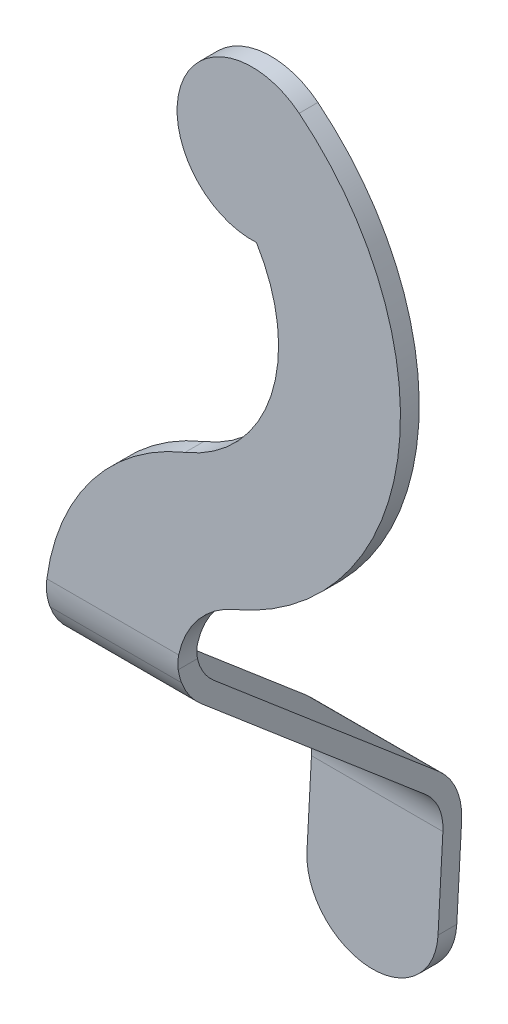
ISO-10303-21;
HEADER;
FILE_DESCRIPTION(('STEP AP214'),'2;1');
FILE_NAME('part.step','',(''),(''),'','','');
FILE_SCHEMA(('AUTOMOTIVE_DESIGN { 1 0 10303 214 1 1 1 1 }'));
ENDSEC;
DATA;
#1=APPLICATION_CONTEXT('core data for automotive mechanical design processes');
#2=APPLICATION_PROTOCOL_DEFINITION('international standard','automotive_design',2000,#1);
#3=PRODUCT_CONTEXT('',#1,'mechanical');
#4=PRODUCT('Part','Part','',(#3));
#5=PRODUCT_RELATED_PRODUCT_CATEGORY('part','',(#4));
#6=PRODUCT_DEFINITION_FORMATION('','',#4);
#7=PRODUCT_DEFINITION_CONTEXT('part definition',#1,'design');
#8=PRODUCT_DEFINITION('design','',#6,#7);
#9=PRODUCT_DEFINITION_SHAPE('','',#8);
#10=(LENGTH_UNIT() NAMED_UNIT(*) SI_UNIT(.MILLI.,.METRE.));
#11=(NAMED_UNIT(*) PLANE_ANGLE_UNIT() SI_UNIT($,.RADIAN.));
#12=(NAMED_UNIT(*) SI_UNIT($,.STERADIAN.) SOLID_ANGLE_UNIT());
#13=UNCERTAINTY_MEASURE_WITH_UNIT(LENGTH_MEASURE(1.E-05),#10,'distance_accuracy_value','');
#14=(GEOMETRIC_REPRESENTATION_CONTEXT(3) GLOBAL_UNCERTAINTY_ASSIGNED_CONTEXT((#13)) GLOBAL_UNIT_ASSIGNED_CONTEXT((#10,
#11,#12)) REPRESENTATION_CONTEXT('',''));
#15=CARTESIAN_POINT('',(0.,0.,0.));
#16=DIRECTION('',(0.,0.,1.));
#17=DIRECTION('',(1.,0.,0.));
#18=AXIS2_PLACEMENT_3D('',#15,#16,#17);
#19=CARTESIAN_POINT('',(-10.,0.,0.999999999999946));
#20=DIRECTION('',(0.,0.,-1.));
#21=DIRECTION('',(0.,1.,0.));
#22=AXIS2_PLACEMENT_3D('',#19,#20,#21);
#23=PLANE('',#22);
#24=DIRECTION('',(1.,0.,0.));
#25=VECTOR('',#24,1.);
#26=CARTESIAN_POINT('',(-10.,20.842816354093,0.999999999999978));
#27=LINE('',#26,#25);
#28=CARTESIAN_POINT('',(-2.36711950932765,20.842816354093,0.999999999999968));
#29=VERTEX_POINT('',#28);
#30=CARTESIAN_POINT('',(4.66500634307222,20.842816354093,0.999999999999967));
#31=VERTEX_POINT('',#30);
#32=EDGE_CURVE('E446',#29,#31,#27,.T.);
#33=ORIENTED_EDGE('',*,*,#32,.T.);
#34=CARTESIAN_POINT('',(9.55611055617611,19.8049822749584,0.999999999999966));
#35=DIRECTION('',(0.,0.,-1.));
#36=DIRECTION('',(0.,1.,0.));
#37=AXIS2_PLACEMENT_3D('',#34,#35,#36);
#38=CIRCLE('',#37,4.99999999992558);
#39=CARTESIAN_POINT('',(7.61659852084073,24.4134845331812,0.999999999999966));
#40=VERTEX_POINT('',#39);
#41=EDGE_CURVE('E564',#31,#40,#38,.T.);
#42=ORIENTED_EDGE('',*,*,#41,.T.);
#43=CARTESIAN_POINT('',(1.99201361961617,37.7781410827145,0.999999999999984));
#44=DIRECTION('',(0.,0.,-1.));
#45=DIRECTION('',(0.,1.,0.));
#46=AXIS2_PLACEMENT_3D('',#43,#44,#45);
#47=CIRCLE('',#46,14.4999999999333);
#48=CARTESIAN_POINT('',(11.0888032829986,49.0696608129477,0.99999999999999));
#49=VERTEX_POINT('',#48);
#50=EDGE_CURVE('E614',#49,#40,#47,.T.);
#51=ORIENTED_EDGE('',*,*,#50,.F.);
#52=CARTESIAN_POINT('',(8.57934406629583,45.9547588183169,0.999999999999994));
#53=DIRECTION('',(0.,0.,-1.));
#54=DIRECTION('',(0.,1.,0.));
#55=AXIS2_PLACEMENT_3D('',#52,#53,#54);
#56=CIRCLE('',#55,3.99999999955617);
#57=CARTESIAN_POINT('',(8.81108233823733,41.9614772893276,0.99999999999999));
#58=VERTEX_POINT('',#57);
#59=EDGE_CURVE('E608',#58,#49,#56,.T.);
#60=ORIENTED_EDGE('',*,*,#59,.F.);
#61=CARTESIAN_POINT('',(1.99201361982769,37.778141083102,0.999999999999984));
#62=DIRECTION('',(0.,0.,-1.));
#63=DIRECTION('',(0.,1.,0.));
#64=AXIS2_PLACEMENT_3D('',#61,#62,#63);
#65=CIRCLE('',#64,8.00000000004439);
#66=CARTESIAN_POINT('',(5.00598510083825,30.3676096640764,0.999999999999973));
#67=VERTEX_POINT('',#66);
#68=EDGE_CURVE('E604',#58,#67,#65,.T.);
#69=ORIENTED_EDGE('',*,*,#68,.T.);
#70=CARTESIAN_POINT('',(9.52694232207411,19.2518125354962,0.999999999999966));
#71=DIRECTION('',(0.,0.,-1.));
#72=DIRECTION('',(0.,1.,0.));
#73=AXIS2_PLACEMENT_3D('',#70,#71,#72);
#74=CIRCLE('',#73,11.9999999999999);
#75=EDGE_CURVE('E601',#29,#67,#74,.T.);
#76=ORIENTED_EDGE('',*,*,#75,.F.);
#77=EDGE_LOOP('',(#33,#42,#51,#60,#69,#76));
#78=FACE_BOUND('',#77,.T.);
#79=ADVANCED_FACE('F114',(#78),#23,.F.);
#80=CARTESIAN_POINT('',(-10.,19.3387542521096,0.70670391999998));
#81=CARTESIAN_POINT('',(-10.,19.3988779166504,0.729932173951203));
#82=CARTESIAN_POINT('',(-10.,19.5190078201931,0.776343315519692));
#83=CARTESIAN_POINT('',(-10.,19.703047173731,0.8349949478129));
#84=CARTESIAN_POINT('',(-10.,19.8894266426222,0.885510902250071));
#85=CARTESIAN_POINT('',(-10.,20.141069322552,0.940537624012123));
#86=CARTESIAN_POINT('',(-10.,20.4593617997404,0.98922796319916));
#87=CARTESIAN_POINT('',(-10.,20.715222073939,0.996415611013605));
#88=CARTESIAN_POINT('',(-10.,20.842816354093,0.999999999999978));
#89=B_SPLINE_CURVE_WITH_KNOTS('',3,(#80,#81,#82,#83,#84,#85,#86,#87,#88),.UNSPECIFIED.,.F.,.F.,
(4,1,1,1,1,1,4),(0.,0.125110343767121,0.249976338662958,0.374880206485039,0.500103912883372,
0.750708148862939,1.),.UNSPECIFIED.);
#90=DIRECTION('',(1.,0.,0.));
#91=VECTOR('',#90,1.);
#92=SURFACE_OF_LINEAR_EXTRUSION('',#89,#91);
#93=CARTESIAN_POINT('',(4.56304703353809,20.0682628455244,0.923431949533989));
#94=CARTESIAN_POINT('',(4.56140497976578,20.0371216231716,0.917239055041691));
#95=CARTESIAN_POINT('',(4.5597663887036,20.0060460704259,0.910714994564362));
#96=CARTESIAN_POINT('',(4.55649746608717,19.9440516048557,0.89696034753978));
#97=CARTESIAN_POINT('',(4.55486713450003,19.9131326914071,0.889729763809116));
#98=CARTESIAN_POINT('',(4.54999018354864,19.8206422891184,0.866910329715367));
#99=CARTESIAN_POINT('',(4.54675793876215,19.759343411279,0.850195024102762));
#100=CARTESIAN_POINT('',(4.54247761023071,19.6781678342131,0.826162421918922));
#101=CARTESIAN_POINT('',(4.54141083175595,19.6579365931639,0.820014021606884));
#102=CARTESIAN_POINT('',(4.5392827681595,19.6175782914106,0.807387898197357));
#103=CARTESIAN_POINT('',(4.53822148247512,19.5974512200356,0.800910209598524));
#104=CARTESIAN_POINT('',(4.53610421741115,19.5572977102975,0.787584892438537));
#105=CARTESIAN_POINT('',(4.53504824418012,19.5372713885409,0.780736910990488));
#106=CARTESIAN_POINT('',(4.53294351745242,19.4973556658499,0.766647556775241));
#107=CARTESIAN_POINT('',(4.53189476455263,19.4774662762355,0.75940615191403));
#108=CARTESIAN_POINT('',(4.5298003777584,19.4377466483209,0.744652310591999));
#109=CARTESIAN_POINT('',(4.52875475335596,19.4179165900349,0.737139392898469));
#110=CARTESIAN_POINT('',(4.52666626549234,19.3783088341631,0.721985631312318));
#111=CARTESIAN_POINT('',(4.52562340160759,19.3585311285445,0.714344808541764));
#112=CARTESIAN_POINT('',(4.52458058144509,19.3387542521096,0.70670391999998));
#113=B_SPLINE_CURVE_WITH_KNOTS('',3,(#93,#94,#95,#96,#97,#98,#99,#100,#101,#102,#103,#104,#105,
#106,#107,#108,#109,#110,#111,#112),.UNSPECIFIED.,.F.,.F.,(4,2,2,2,2,2,2,2,2,4),(0.,
0.095377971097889,0.190755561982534,0.381529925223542,0.445044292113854,0.508552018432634,
0.572121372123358,0.635695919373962,0.699389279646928,0.763072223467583),.UNSPECIFIED.);
#114=CARTESIAN_POINT('',(4.56304703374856,20.0682628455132,0.923431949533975));
#115=VERTEX_POINT('',#114);
#116=CARTESIAN_POINT('',(4.52458058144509,19.3387542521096,0.70670391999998));
#117=VERTEX_POINT('',#116);
#118=EDGE_CURVE('E124',#115,#117,#113,.T.);
#119=ORIENTED_EDGE('',*,*,#118,.F.);
#120=CARTESIAN_POINT('',(4.56304703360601,20.0682628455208,0.923431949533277));
#121=CARTESIAN_POINT('',(4.5664090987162,20.1320939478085,0.936115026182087));
#122=CARTESIAN_POINT('',(4.57101981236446,20.1961820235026,0.947466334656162));
#123=CARTESIAN_POINT('',(4.58274687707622,20.3243788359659,0.966758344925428));
#124=CARTESIAN_POINT('',(4.58985343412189,20.3884865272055,0.974712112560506));
#125=CARTESIAN_POINT('',(4.60673701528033,20.5177300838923,0.986663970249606));
#126=CARTESIAN_POINT('',(4.61655401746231,20.5828663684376,0.990598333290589));
#127=CARTESIAN_POINT('',(4.63881491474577,20.7130594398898,0.996367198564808));
#128=CARTESIAN_POINT('',(4.651269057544,20.7781148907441,0.998193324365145));
#129=CARTESIAN_POINT('',(4.66500634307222,20.842816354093,0.999999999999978));
#130=B_SPLINE_CURVE_WITH_KNOTS('',3,(#120,#121,#122,#123,#124,#125,#126,#127,#128,#129),
.UNSPECIFIED.,.F.,.F.,(4,2,2,2,4),(0.,0.195565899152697,0.390372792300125,0.588222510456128,
0.786855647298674),.UNSPECIFIED.);
#131=EDGE_CURVE('E562',#115,#31,#130,.T.);
#132=ORIENTED_EDGE('',*,*,#131,.T.);
#133=ORIENTED_EDGE('',*,*,#32,.F.);
#134=CARTESIAN_POINT('',(-2.45641013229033,19.8836859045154,0.882464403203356));
#135=CARTESIAN_POINT('',(-2.45475858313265,19.9150104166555,0.890184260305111));
#136=CARTESIAN_POINT('',(-2.45297888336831,19.9464232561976,0.897510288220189));
#137=CARTESIAN_POINT('',(-2.4491609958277,20.0094032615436,0.911433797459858));
#138=CARTESIAN_POINT('',(-2.447122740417,20.0409704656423,0.918031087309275));
#139=CARTESIAN_POINT('',(-2.44279366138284,20.104114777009,0.930531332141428));
#140=CARTESIAN_POINT('',(-2.44050370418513,20.1356914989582,0.936436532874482));
#141=CARTESIAN_POINT('',(-2.43566341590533,20.1989503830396,0.947505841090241));
#142=CARTESIAN_POINT('',(-2.4331131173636,20.2306325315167,0.952670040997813));
#143=CARTESIAN_POINT('',(-2.42637457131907,20.310365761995,0.964618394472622));
#144=CARTESIAN_POINT('',(-2.42201674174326,20.3584841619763,0.970876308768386));
#145=CARTESIAN_POINT('',(-2.41502488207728,20.4307978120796,0.978631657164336));
#146=CARTESIAN_POINT('',(-2.41261790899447,20.4549296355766,0.980945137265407));
#147=CARTESIAN_POINT('',(-2.40765265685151,20.5032245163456,0.985021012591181));
#148=CARTESIAN_POINT('',(-2.4050943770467,20.5273875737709,0.986783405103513));
#149=CARTESIAN_POINT('',(-2.39716917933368,20.6001267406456,0.991438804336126));
#150=CARTESIAN_POINT('',(-2.39157463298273,20.6487175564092,0.993676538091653));
#151=CARTESIAN_POINT('',(-2.37979134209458,20.7458300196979,0.997276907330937));
#152=CARTESIAN_POINT('',(-2.37360298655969,20.7943516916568,0.998640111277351));
#153=CARTESIAN_POINT('',(-2.36711950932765,20.842816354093,0.999999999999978));
#154=B_SPLINE_CURVE_WITH_KNOTS('',3,(#134,#135,#136,#137,#138,#139,#140,#141,#142,#143,#144,
#145,#146,#147,#148,#149,#150,#151,#152,#153),.UNSPECIFIED.,.F.,.F.,(4,2,2,2,2,2,2,2,2,4),(0.,
0.0969062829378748,0.193837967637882,0.290445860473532,0.387041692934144,0.533144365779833,
0.606223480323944,0.679302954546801,0.826173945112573,0.97294936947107),.UNSPECIFIED.);
#155=CARTESIAN_POINT('',(-2.45641013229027,19.8836859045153,0.882464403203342));
#156=VERTEX_POINT('',#155);
#157=EDGE_CURVE('E140',#156,#29,#154,.T.);
#158=ORIENTED_EDGE('',*,*,#157,.F.);
#159=CARTESIAN_POINT('',(-2.48514397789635,19.3387542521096,0.70670391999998));
#160=CARTESIAN_POINT('',(-2.48357691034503,19.3684733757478,0.718183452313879));
#161=CARTESIAN_POINT('',(-2.48200951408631,19.3981987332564,0.729668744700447));
#162=CARTESIAN_POINT('',(-2.47886763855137,19.4577837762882,0.752188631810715));
#163=CARTESIAN_POINT('',(-2.47729316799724,19.4876432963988,0.763223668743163));
#164=CARTESIAN_POINT('',(-2.47412853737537,19.5476598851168,0.784399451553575));
#165=CARTESIAN_POINT('',(-2.47253838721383,19.5778167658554,0.794540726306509));
#166=CARTESIAN_POINT('',(-2.46934490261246,19.6383805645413,0.814037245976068));
#167=CARTESIAN_POINT('',(-2.467741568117,19.6687874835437,0.823392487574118));
#168=CARTESIAN_POINT('',(-2.46452364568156,19.7298147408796,0.841445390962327));
#169=CARTESIAN_POINT('',(-2.46290905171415,19.7604351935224,0.850142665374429));
#170=CARTESIAN_POINT('',(-2.45966799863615,19.8219011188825,0.866840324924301));
#171=CARTESIAN_POINT('',(-2.45804152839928,19.8527468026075,0.874839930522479));
#172=CARTESIAN_POINT('',(-2.45641013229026,19.8836859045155,0.882464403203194));
#173=B_SPLINE_CURVE_WITH_KNOTS('',3,(#159,#160,#161,#162,#163,#164,#165,#166,#167,#168,#169,
#170,#171,#172),.UNSPECIFIED.,.F.,.F.,(4,2,2,2,2,2,4),(0.,0.0957068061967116,0.191317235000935,
0.28687070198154,0.382424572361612,0.47803426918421,0.573749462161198),.UNSPECIFIED.);
#174=CARTESIAN_POINT('',(-2.48514397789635,19.3387542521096,0.70670391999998));
#175=VERTEX_POINT('',#174);
#176=EDGE_CURVE('E389',#175,#156,#173,.T.);
#177=ORIENTED_EDGE('',*,*,#176,.F.);
#178=DIRECTION('',(1.,0.,0.));
#179=VECTOR('',#178,1.);
#180=CARTESIAN_POINT('',(-10.,19.3387542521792,0.706703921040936));
#181=LINE('',#180,#179);
#182=EDGE_CURVE('E372',#175,#117,#181,.T.);
#183=ORIENTED_EDGE('',*,*,#182,.T.);
#184=EDGE_LOOP('',(#119,#132,#133,#158,#177,#183));
#185=FACE_BOUND('',#184,.T.);
#186=ADVANCED_FACE('F306',(#185),#92,.F.);
#187=CARTESIAN_POINT('',(-10.,20.855369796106,-3.00000000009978));
#188=DIRECTION('',(-1.,0.,0.));
#189=DIRECTION('',(0.,1.,1.59339260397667E-11));
#190=AXIS2_PLACEMENT_3D('',#187,#188,#189);
#191=ELLIPSE('',#190,4.03504171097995,3.99999999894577);
#192=DIRECTION('',(1.,0.,0.));
#193=VECTOR('',#192,1.);
#194=SURFACE_OF_LINEAR_EXTRUSION('',#191,#193);
#195=CARTESIAN_POINT('',(4.52458058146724,19.3387542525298,0.706703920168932));
#196=CARTESIAN_POINT('',(4.51897737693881,19.2324905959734,0.663990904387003));
#197=CARTESIAN_POINT('',(4.51346976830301,19.1280398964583,0.616751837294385));
#198=CARTESIAN_POINT('',(4.50268231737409,18.9234580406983,0.513571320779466));
#199=CARTESIAN_POINT('',(4.49740257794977,18.8233288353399,0.457625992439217));
#200=CARTESIAN_POINT('',(4.48721429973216,18.6301101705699,0.338610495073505));
#201=CARTESIAN_POINT('',(4.48230048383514,18.5369206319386,0.275703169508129));
#202=CARTESIAN_POINT('',(4.47276866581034,18.3561516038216,0.142353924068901));
#203=CARTESIAN_POINT('',(4.46815050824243,18.268569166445,0.0719160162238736));
#204=CARTESIAN_POINT('',(4.45991825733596,18.1124461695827,-0.064790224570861));
#205=CARTESIAN_POINT('',(4.45625824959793,18.043034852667,-0.130064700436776));
#206=CARTESIAN_POINT('',(4.44916133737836,17.9084433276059,-0.265962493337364));
#207=CARTESIAN_POINT('',(4.44572660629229,17.8433043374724,-0.336626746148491));
#208=CARTESIAN_POINT('',(4.4424300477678,17.7807857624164,-0.409554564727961));
#209=B_SPLINE_CURVE_WITH_KNOTS('',3,(#195,#196,#197,#198,#199,#200,#201,#202,#203,#204,#205,
#206,#207,#208),.UNSPECIFIED.,.F.,.F.,(4,2,2,2,2,2,4),(0.,0.343891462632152,0.687936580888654,
1.02517554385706,1.36223572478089,1.6480581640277,1.9363226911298),.UNSPECIFIED.);
#210=CARTESIAN_POINT('',(4.4424300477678,17.7807857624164,-0.40955456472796));
#211=VERTEX_POINT('',#210);
#212=EDGE_CURVE('E407',#117,#211,#209,.T.);
#213=ORIENTED_EDGE('',*,*,#212,.F.);
#214=ORIENTED_EDGE('',*,*,#182,.F.);
#215=CARTESIAN_POINT('',(-2.56729451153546,17.7807857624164,-0.40955456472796));
#216=CARTESIAN_POINT('',(-2.56336189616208,17.8553670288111,-0.322545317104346));
#217=CARTESIAN_POINT('',(-2.55923189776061,17.9336916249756,-0.238757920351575));
#218=CARTESIAN_POINT('',(-2.55060894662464,18.0972241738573,-0.0781540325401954));
#219=CARTESIAN_POINT('',(-2.54611586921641,18.1824344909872,-0.00133995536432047));
#220=CARTESIAN_POINT('',(-2.53689303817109,18.3573436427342,0.143291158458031));
#221=CARTESIAN_POINT('',(-2.53216968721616,18.4469210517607,0.211255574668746));
#222=CARTESIAN_POINT('',(-2.52244332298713,18.6313796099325,0.339440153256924));
#223=CARTESIAN_POINT('',(-2.51744045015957,18.7262580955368,0.3996641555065));
#224=CARTESIAN_POINT('',(-2.50796810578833,18.905899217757,0.503460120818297));
#225=CARTESIAN_POINT('',(-2.50353311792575,18.9900078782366,0.548171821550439));
#226=CARTESIAN_POINT('',(-2.49447008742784,19.1618864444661,0.631915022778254));
#227=CARTESIAN_POINT('',(-2.48984072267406,19.2496814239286,0.670894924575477));
#228=CARTESIAN_POINT('',(-2.48514397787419,19.3387542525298,0.706703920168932));
#229=B_SPLINE_CURVE_WITH_KNOTS('',3,(#215,#216,#217,#218,#219,#220,#221,#222,#223,#224,#225,
#226,#227,#228),.UNSPECIFIED.,.F.,.F.,(4,2,2,2,2,2,4),(0.,0.343891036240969,0.687900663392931,
1.02513625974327,1.36220390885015,1.64804604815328,1.93632168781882),.UNSPECIFIED.);
#230=CARTESIAN_POINT('',(-2.56729451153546,17.7807857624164,-0.40955456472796));
#231=VERTEX_POINT('',#230);
#232=EDGE_CURVE('E465',#231,#175,#229,.T.);
#233=ORIENTED_EDGE('',*,*,#232,.F.);
#234=DIRECTION('',(1.,0.,0.));
#235=VECTOR('',#234,1.);
#236=CARTESIAN_POINT('',(-10.,17.7807857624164,-0.409554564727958));
#237=LINE('',#236,#235);
#238=EDGE_CURVE('E369',#231,#211,#237,.T.);
#239=ORIENTED_EDGE('',*,*,#238,.T.);
#240=EDGE_LOOP('',(#213,#214,#233,#239));
#241=FACE_BOUND('',#240,.T.);
#242=ADVANCED_FACE('F457',(#241),#194,.F.);
#243=CARTESIAN_POINT('',(-10.,10.4502579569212,-8.95965251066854));
#244=DIRECTION('',(0.,0.759174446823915,-0.650887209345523));
#245=DIRECTION('',(0.,0.650887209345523,0.759174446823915));
#246=AXIS2_PLACEMENT_3D('',#243,#244,#245);
#247=PLANE('',#246);
#248=DIRECTION('',(-0.0343006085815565,-0.650504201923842,-0.758727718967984));
#249=VECTOR('',#248,1.);
#250=CARTESIAN_POINT('',(4.03935949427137,10.1366330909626,-9.32545472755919));
#251=LINE('',#250,#249);
#252=CARTESIAN_POINT('',(3.87582478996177,7.0352300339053,-12.9428340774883));
#253=VERTEX_POINT('',#252);
#254=EDGE_CURVE('E531',#211,#253,#251,.T.);
#255=ORIENTED_EDGE('',*,*,#254,.F.);
#256=ORIENTED_EDGE('',*,*,#238,.F.);
#257=DIRECTION('',(0.034300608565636,0.650504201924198,0.758727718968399));
#258=VECTOR('',#257,1.);
#259=CARTESIAN_POINT('',(-2.96211790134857,10.2930389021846,-9.14302788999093));
#260=LINE('',#259,#258);
#261=CARTESIAN_POINT('',(-3.13389976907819,7.0352300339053,-12.9428340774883));
#262=VERTEX_POINT('',#261);
#263=EDGE_CURVE('E473',#262,#231,#260,.T.);
#264=ORIENTED_EDGE('',*,*,#263,.F.);
#265=DIRECTION('',(1.,0.,0.));
#266=VECTOR('',#265,1.);
#267=CARTESIAN_POINT('',(-10.,7.0352300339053,-12.9428340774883));
#268=LINE('',#267,#266);
#269=EDGE_CURVE('E365',#262,#253,#268,.T.);
#270=ORIENTED_EDGE('',*,*,#269,.T.);
#271=EDGE_LOOP('',(#255,#256,#264,#270));
#272=FACE_BOUND('',#271,.T.);
#273=ADVANCED_FACE('F461',(#272),#247,.F.);
#274=CARTESIAN_POINT('',(-10.,4.7292920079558,-11.0000000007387));
#275=DIRECTION('',(-1.,0.,0.));
#276=DIRECTION('',(0.,1.,0.));
#277=AXIS2_PLACEMENT_3D('',#274,#275,#276);
#278=ELLIPSE('',#277,3.02628128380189,3.);
#279=DIRECTION('',(1.,0.,0.));
#280=VECTOR('',#279,1.);
#281=SURFACE_OF_LINEAR_EXTRUSION('',#278,#280);
#282=DIRECTION('',(1.,0.,0.));
#283=VECTOR('',#282,1.);
#284=CARTESIAN_POINT('',(-10.,4.72929200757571,-14.0000000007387));
#285=LINE('',#284,#283);
#286=CARTESIAN_POINT('',(-3.25549018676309,4.72929200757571,-14.0000000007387));
#287=VERTEX_POINT('',#286);
#288=CARTESIAN_POINT('',(3.75423437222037,4.72929200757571,-14.0000000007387));
#289=VERTEX_POINT('',#288);
#290=EDGE_CURVE('E361',#287,#289,#285,.T.);
#291=ORIENTED_EDGE('',*,*,#290,.T.);
#292=CARTESIAN_POINT('',(3.75423437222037,4.72929200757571,-14.0000000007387));
#293=CARTESIAN_POINT('',(3.75869049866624,4.8138015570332,-14.000008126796));
#294=CARTESIAN_POINT('',(3.76314657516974,4.89831015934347,-13.9964911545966));
#295=CARTESIAN_POINT('',(3.7720280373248,5.06674531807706,-13.9824654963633));
#296=CARTESIAN_POINT('',(3.77645342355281,5.15067188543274,-13.9719569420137));
#297=CARTESIAN_POINT('',(3.78524323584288,5.31736892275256,-13.9440061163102));
#298=CARTESIAN_POINT('',(3.78960765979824,5.40013935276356,-13.9265636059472));
#299=CARTESIAN_POINT('',(3.79824513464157,5.56394734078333,-13.8848611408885));
#300=CARTESIAN_POINT('',(3.80251818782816,5.64498494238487,-13.8606013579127));
#301=CARTESIAN_POINT('',(3.81093242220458,5.80455921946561,-13.8054931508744));
#302=CARTESIAN_POINT('',(3.81507391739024,5.88310184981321,-13.7746620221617));
#303=CARTESIAN_POINT('',(3.8232078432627,6.03736013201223,-13.7065758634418));
#304=CARTESIAN_POINT('',(3.8272002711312,6.11307573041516,-13.6693207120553));
#305=CARTESIAN_POINT('',(3.83526530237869,6.26602743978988,-13.5859718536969));
#306=CARTESIAN_POINT('',(3.83932588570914,6.34303559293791,-13.5394577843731));
#307=CARTESIAN_POINT('',(3.84721353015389,6.49262319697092,-13.4397579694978));
#308=CARTESIAN_POINT('',(3.85104057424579,6.56520232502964,-13.386571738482));
#309=CARTESIAN_POINT('',(3.85855398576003,6.70769267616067,-13.2720374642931));
#310=CARTESIAN_POINT('',(3.86223131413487,6.77743247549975,-13.2104753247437));
#311=CARTESIAN_POINT('',(3.86927182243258,6.91095431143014,-13.0811638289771));
#312=CARTESIAN_POINT('',(3.87263495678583,6.97473548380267,-13.0134135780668));
#313=CARTESIAN_POINT('',(3.87582478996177,7.0352300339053,-12.9428340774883));
#314=B_SPLINE_CURVE_WITH_KNOTS('',3,(#292,#293,#294,#295,#296,#297,#298,#299,#300,#301,#302,
#303,#304,#305,#306,#307,#308,#309,#310,#311,#312,#313),.UNSPECIFIED.,.F.,.F.,(4,2,2,2,2,2,2,2,
2,2,4),(0.,0.253806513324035,0.507608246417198,0.761418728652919,1.01522281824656,
1.26836698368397,1.52151593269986,1.79132766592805,2.06115904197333,2.34005114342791,
2.61898363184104),.UNSPECIFIED.);
#315=EDGE_CURVE('E416',#289,#253,#314,.T.);
#316=ORIENTED_EDGE('',*,*,#315,.T.);
#317=ORIENTED_EDGE('',*,*,#269,.F.);
#318=CARTESIAN_POINT('',(-3.13389976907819,7.0352300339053,-12.9428340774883));
#319=CARTESIAN_POINT('',(-3.13677985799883,6.98060972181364,-13.0065548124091));
#320=CARTESIAN_POINT('',(-3.13980101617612,6.92331405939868,-13.0679715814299));
#321=CARTESIAN_POINT('',(-3.14610210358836,6.80381519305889,-13.1858047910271));
#322=CARTESIAN_POINT('',(-3.14938201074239,6.74161240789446,-13.2422216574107));
#323=CARTESIAN_POINT('',(-3.15617773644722,6.61273282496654,-13.3496738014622));
#324=CARTESIAN_POINT('',(-3.15969355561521,6.54605601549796,-13.4007090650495));
#325=CARTESIAN_POINT('',(-3.16693608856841,6.40870282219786,-13.4970599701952));
#326=CARTESIAN_POINT('',(-3.17066280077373,6.33802646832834,-13.5423756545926));
#327=CARTESIAN_POINT('',(-3.17830087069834,6.19317199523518,-13.6269865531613));
#328=CARTESIAN_POINT('',(-3.18221221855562,6.11899406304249,-13.6662820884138));
#329=CARTESIAN_POINT('',(-3.19019258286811,5.9676480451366,-13.7385999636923));
#330=CARTESIAN_POINT('',(-3.19426160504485,5.89047985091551,-13.7716220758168));
#331=CARTESIAN_POINT('',(-3.20286737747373,5.72727309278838,-13.8336127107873));
#332=CARTESIAN_POINT('',(-3.20741517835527,5.641024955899,-13.8620295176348));
#333=CARTESIAN_POINT('',(-3.21662634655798,5.46633698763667,-13.9110582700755));
#334=CARTESIAN_POINT('',(-3.22128972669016,5.37789691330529,-13.9316693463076));
#335=CARTESIAN_POINT('',(-3.23085272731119,5.19653651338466,-13.9654842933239));
#336=CARTESIAN_POINT('',(-3.23575502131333,5.10356548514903,-13.9784160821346));
#337=CARTESIAN_POINT('',(-3.24560161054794,4.91682688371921,-13.9956804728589));
#338=CARTESIAN_POINT('',(-3.25054590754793,4.82305927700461,-14.000012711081));
#339=CARTESIAN_POINT('',(-3.25549018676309,4.72929200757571,-14.0000000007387));
#340=B_SPLINE_CURVE_WITH_KNOTS('',3,(#318,#319,#320,#321,#322,#323,#324,#325,#326,#327,#328,
#329,#330,#331,#332,#333,#334,#335,#336,#337,#338,#339),.UNSPECIFIED.,.F.,.F.,(4,2,2,2,2,2,2,2,
2,2,4),(0.,0.251850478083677,0.503679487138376,0.755509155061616,1.00733693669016,
1.25915128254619,1.51097477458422,1.78337541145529,2.05580637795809,2.33738888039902,
2.61898329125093),.UNSPECIFIED.);
#341=EDGE_CURVE('E478',#262,#287,#340,.T.);
#342=ORIENTED_EDGE('',*,*,#341,.T.);
#343=EDGE_LOOP('',(#291,#316,#317,#342));
#344=FACE_BOUND('',#343,.T.);
#345=ADVANCED_FACE('F488',(#344),#281,.T.);
#346=CARTESIAN_POINT('',(-10.,0.,-14.0000000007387));
#347=DIRECTION('',(0.,0.,-1.));
#348=DIRECTION('',(-1.,0.,0.));
#349=AXIS2_PLACEMENT_3D('',#346,#347,#348);
#350=PLANE('',#349);
#351=DIRECTION('',(-0.0526561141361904,-0.998612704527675,0.));
#352=VECTOR('',#351,1.);
#353=CARTESIAN_POINT('',(3.46741780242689,-0.710127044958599,-14.0000000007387));
#354=LINE('',#353,#352);
#355=CARTESIAN_POINT('',(3.49514446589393,-0.184296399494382,-14.0000000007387));
#356=VERTEX_POINT('',#355);
#357=EDGE_CURVE('E537',#289,#356,#354,.T.);
#358=ORIENTED_EDGE('',*,*,#357,.F.);
#359=ORIENTED_EDGE('',*,*,#290,.F.);
#360=DIRECTION('',(0.0526561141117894,0.998612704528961,0.));
#361=VECTOR('',#360,1.);
#362=CARTESIAN_POINT('',(-3.52287112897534,-0.341534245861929,-14.0000000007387));
#363=LINE('',#362,#361);
#364=CARTESIAN_POINT('',(-3.49514446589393,0.184296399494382,-14.0000000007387));
#365=VERTEX_POINT('',#364);
#366=EDGE_CURVE('E486',#365,#287,#363,.T.);
#367=ORIENTED_EDGE('',*,*,#366,.F.);
#368=CARTESIAN_POINT('',(0.,0.,-14.0000000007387));
#369=DIRECTION('',(0.,0.,-1.));
#370=DIRECTION('',(-1.,0.,0.));
#371=AXIS2_PLACEMENT_3D('',#368,#369,#370);
#372=CIRCLE('',#371,3.50000000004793);
#373=EDGE_CURVE('E13',#356,#365,#372,.T.);
#374=ORIENTED_EDGE('',*,*,#373,.F.);
#375=EDGE_LOOP('',(#358,#359,#367,#374));
#376=FACE_BOUND('',#375,.T.);
#377=ADVANCED_FACE('F492',(#376),#350,.F.);
#378=CARTESIAN_POINT('',(0.,0.,-14.9999999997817));
#379=DIRECTION('',(0.,0.,1.));
#380=DIRECTION('',(1.,0.,0.));
#381=AXIS2_PLACEMENT_3D('',#378,#379,#380);
#382=CYLINDRICAL_SURFACE('',#381,3.50000000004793);
#383=CARTESIAN_POINT('',(0.,0.,-14.9999999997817));
#384=DIRECTION('',(0.,0.,1.));
#385=DIRECTION('',(1.,0.,0.));
#386=AXIS2_PLACEMENT_3D('',#383,#384,#385);
#387=CIRCLE('',#386,3.50000000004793);
#388=CARTESIAN_POINT('',(-3.49514446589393,0.184296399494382,-14.9999999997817));
#389=VERTEX_POINT('',#388);
#390=CARTESIAN_POINT('',(3.49514446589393,-0.184296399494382,-14.9999999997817));
#391=VERTEX_POINT('',#390);
#392=EDGE_CURVE('E250',#389,#391,#387,.T.);
#393=ORIENTED_EDGE('',*,*,#392,.T.);
#394=DIRECTION('',(0.,0.,1.));
#395=VECTOR('',#394,1.);
#396=CARTESIAN_POINT('',(3.49514446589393,-0.184296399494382,-14.9999999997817));
#397=LINE('',#396,#395);
#398=EDGE_CURVE('E257',#391,#356,#397,.T.);
#399=ORIENTED_EDGE('',*,*,#398,.T.);
#400=ORIENTED_EDGE('',*,*,#373,.T.);
#401=DIRECTION('',(0.,0.,1.));
#402=VECTOR('',#401,1.);
#403=CARTESIAN_POINT('',(-3.49514446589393,0.184296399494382,-14.9999999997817));
#404=LINE('',#403,#402);
#405=EDGE_CURVE('E243',#389,#365,#404,.T.);
#406=ORIENTED_EDGE('',*,*,#405,.F.);
#407=EDGE_LOOP('',(#393,#399,#400,#406));
#408=FACE_BOUND('',#407,.T.);
#409=ADVANCED_FACE('F253',(#408),#382,.T.);
#410=CARTESIAN_POINT('',(3.49514446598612,-0.18429639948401,-14.9999999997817));
#411=DIRECTION('',(0.998612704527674,-0.0526561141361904,0.));
#412=DIRECTION('',(0.0526561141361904,0.998612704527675,0.));
#413=AXIS2_PLACEMENT_3D('',#410,#411,#412);
#414=PLANE('',#413);
#415=CARTESIAN_POINT('',(4.52458058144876,19.3387542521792,-0.403915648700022));
#416=CARTESIAN_POINT('',(4.52610158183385,19.3675997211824,-0.388307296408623));
#417=CARTESIAN_POINT('',(4.52762250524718,19.3964437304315,-0.372679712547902));
#418=CARTESIAN_POINT('',(4.53067752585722,19.4543815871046,-0.341864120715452));
#419=CARTESIAN_POINT('',(4.53221162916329,19.4834755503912,-0.326676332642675));
#420=CARTESIAN_POINT('',(4.53529831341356,19.5420139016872,-0.297297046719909));
#421=CARTESIAN_POINT('',(4.53685078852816,19.5714562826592,-0.283101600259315));
#422=CARTESIAN_POINT('',(4.53998491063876,19.6308942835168,-0.255942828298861));
#423=CARTESIAN_POINT('',(4.54156655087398,19.6608897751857,-0.242979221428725));
#424=CARTESIAN_POINT('',(4.54477481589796,19.7217338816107,-0.217941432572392));
#425=CARTESIAN_POINT('',(4.54640176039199,19.7525885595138,-0.20588212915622));
#426=CARTESIAN_POINT('',(4.54967508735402,19.8146665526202,-0.182735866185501));
#427=CARTESIAN_POINT('',(4.55132147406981,19.845889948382,-0.171649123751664));
#428=CARTESIAN_POINT('',(4.55463868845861,19.9088002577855,-0.150388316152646));
#429=CARTESIAN_POINT('',(4.55630959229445,19.9404886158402,-0.140218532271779));
#430=CARTESIAN_POINT('',(4.55966682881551,20.0041579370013,-0.120897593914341));
#431=CARTESIAN_POINT('',(4.56135315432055,20.0361387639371,-0.111745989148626));
#432=CARTESIAN_POINT('',(4.5630470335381,20.0682628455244,-0.103124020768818));
#433=B_SPLINE_CURVE_WITH_KNOTS('',3,(#415,#416,#417,#418,#419,#420,#421,#422,#423,#424,#425,
#426,#427,#428,#429,#430,#431,#432),.UNSPECIFIED.,.F.,.F.,(4,2,2,2,2,2,2,2,4),(0.,
0.0985119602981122,0.197072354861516,0.295215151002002,0.393335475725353,0.49282052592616,
0.592327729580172,0.692277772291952,0.792183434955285),.UNSPECIFIED.);
#434=CARTESIAN_POINT('',(4.52458058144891,19.3387542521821,-0.403915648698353));
#435=VERTEX_POINT('',#434);
#436=CARTESIAN_POINT('',(4.56304703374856,20.0682628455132,-0.103124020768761));
#437=VERTEX_POINT('',#436);
#438=EDGE_CURVE('E439',#435,#437,#433,.T.);
#439=ORIENTED_EDGE('',*,*,#438,.T.);
#440=DIRECTION('',(0.,0.,1.));
#441=VECTOR('',#440,1.);
#442=CARTESIAN_POINT('',(4.56304703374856,20.0682628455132,-14.9999999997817));
#443=LINE('',#442,#441);
#444=EDGE_CURVE('E281',#437,#115,#443,.T.);
#445=ORIENTED_EDGE('',*,*,#444,.T.);
#446=ORIENTED_EDGE('',*,*,#118,.T.);
#447=ORIENTED_EDGE('',*,*,#212,.T.);
#448=ORIENTED_EDGE('',*,*,#254,.T.);
#449=ORIENTED_EDGE('',*,*,#315,.F.);
#450=ORIENTED_EDGE('',*,*,#357,.T.);
#451=ORIENTED_EDGE('',*,*,#398,.F.);
#452=DIRECTION('',(0.0526561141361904,0.998612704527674,0.));
#453=VECTOR('',#452,1.);
#454=CARTESIAN_POINT('',(3.49514446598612,-0.18429639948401,-14.9999999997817));
#455=LINE('',#454,#453);
#456=CARTESIAN_POINT('',(3.75423437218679,4.729292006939,-14.9999999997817));
#457=VERTEX_POINT('',#456);
#458=EDGE_CURVE('E262',#391,#457,#455,.T.);
#459=ORIENTED_EDGE('',*,*,#458,.T.);
#460=CARTESIAN_POINT('',(3.75423437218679,4.729292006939,-14.9999999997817));
#461=CARTESIAN_POINT('',(3.76017587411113,4.84197140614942,-15.0000108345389));
#462=CARTESIAN_POINT('',(3.76611730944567,4.95464954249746,-14.9953215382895));
#463=CARTESIAN_POINT('',(3.7779592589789,5.17922975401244,-14.9766206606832));
#464=CARTESIAN_POINT('',(3.78385977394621,5.29113184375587,-14.9626092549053));
#465=CARTESIAN_POINT('',(3.79557952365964,5.51339456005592,-14.9253414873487));
#466=CARTESIAN_POINT('',(3.80139875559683,5.62375513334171,-14.9020848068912));
#467=CARTESIAN_POINT('',(3.81291538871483,5.84216578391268,-14.8464815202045));
#468=CARTESIAN_POINT('',(3.81861279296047,5.95021591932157,-14.8141351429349));
#469=CARTESIAN_POINT('',(3.82983177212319,6.16298162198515,-14.7406575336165));
#470=CARTESIAN_POINT('',(3.83535376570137,6.2677051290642,-14.6995493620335));
#471=CARTESIAN_POINT('',(3.84619900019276,6.47338283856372,-14.6087678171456));
#472=CARTESIAN_POINT('',(3.85152223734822,6.57433696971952,-14.5590942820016));
#473=CARTESIAN_POINT('',(3.86227561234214,6.77827258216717,-14.4479624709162));
#474=CARTESIAN_POINT('',(3.8676897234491,6.88095011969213,-14.3859437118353));
#475=CARTESIAN_POINT('',(3.87820658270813,7.08040025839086,-14.2530106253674));
#476=CARTESIAN_POINT('',(3.88330930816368,7.17717242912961,-14.1820956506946));
#477=CARTESIAN_POINT('',(3.89332719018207,7.36715956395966,-14.0293832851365));
#478=CARTESIAN_POINT('',(3.89823029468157,7.46014596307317,-13.9473004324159));
#479=CARTESIAN_POINT('',(3.90761763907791,7.63817507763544,-13.7748851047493));
#480=CARTESIAN_POINT('',(3.91210181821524,7.72321664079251,-13.6845514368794));
#481=CARTESIAN_POINT('',(3.91635492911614,7.8038760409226,-13.5904454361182));
#482=B_SPLINE_CURVE_WITH_KNOTS('',3,(#460,#461,#462,#463,#464,#465,#466,#467,#468,#469,#470,
#471,#472,#473,#474,#475,#476,#477,#478,#479,#480,#481),.UNSPECIFIED.,.F.,.F.,(4,2,2,2,2,2,2,2,
2,2,4),(0.,0.338408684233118,0.676810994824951,1.01522497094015,1.35363042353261,
1.69115597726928,2.02868790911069,2.38843688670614,2.74821205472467,3.1200681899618,
3.49197817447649),.UNSPECIFIED.);
#483=CARTESIAN_POINT('',(3.91635492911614,7.8038760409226,-13.5904454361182));
#484=VERTEX_POINT('',#483);
#485=EDGE_CURVE('E424',#457,#484,#482,.T.);
#486=ORIENTED_EDGE('',*,*,#485,.T.);
#487=DIRECTION('',(0.0343006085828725,0.650504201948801,0.758727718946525));
#488=VECTOR('',#487,1.);
#489=CARTESIAN_POINT('',(4.07954535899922,10.8987500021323,-9.98068141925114));
#490=LINE('',#489,#488);
#491=CARTESIAN_POINT('',(4.48296018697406,18.5494317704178,-1.05716592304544));
#492=VERTEX_POINT('',#491);
#493=EDGE_CURVE('E440',#484,#492,#490,.T.);
#494=ORIENTED_EDGE('',*,*,#493,.T.);
#495=CARTESIAN_POINT('',(4.52458058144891,19.3387542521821,-0.403915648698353));
#496=CARTESIAN_POINT('',(4.52260689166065,19.3013236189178,-0.425403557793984));
#497=CARTESIAN_POINT('',(4.52065736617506,19.2643512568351,-0.447692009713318));
#498=CARTESIAN_POINT('',(4.51682056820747,19.191587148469,-0.493704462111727));
#499=CARTESIAN_POINT('',(4.51493301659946,19.1557901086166,-0.517420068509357));
#500=CARTESIAN_POINT('',(4.51121942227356,19.0853625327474,-0.566265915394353));
#501=CARTESIAN_POINT('',(4.50939318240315,19.0507282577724,-0.591390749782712));
#502=CARTESIAN_POINT('',(4.50580173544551,18.9826171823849,-0.643041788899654));
#503=CARTESIAN_POINT('',(4.50403642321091,18.9491383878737,-0.669565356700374));
#504=CARTESIAN_POINT('',(4.50056656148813,18.8833331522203,-0.724010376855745));
#505=CARTESIAN_POINT('',(4.49886201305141,18.8510067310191,-0.751931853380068));
#506=CARTESIAN_POINT('',(4.49551382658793,18.7875090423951,-0.809175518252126));
#507=CARTESIAN_POINT('',(4.493870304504,18.7563399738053,-0.838500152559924));
#508=CARTESIAN_POINT('',(4.49064468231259,18.6951666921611,-0.898560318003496));
#509=CARTESIAN_POINT('',(4.48906282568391,18.6651670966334,-0.929300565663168));
#510=CARTESIAN_POINT('',(4.48596137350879,18.6063486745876,-0.992208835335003));
#511=CARTESIAN_POINT('',(4.48444216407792,18.5775371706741,-1.02438372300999));
#512=CARTESIAN_POINT('',(4.48296018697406,18.5494317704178,-1.05716592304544));
#513=B_SPLINE_CURVE_WITH_KNOTS('',3,(#495,#496,#497,#498,#499,#500,#501,#502,#503,#504,#505,
#506,#507,#508,#509,#510,#511,#512),.UNSPECIFIED.,.F.,.F.,(4,2,2,2,2,2,2,2,4),(0.,
0.129605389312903,0.25851151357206,0.386953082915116,0.515160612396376,0.643370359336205,
0.771812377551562,0.900718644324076,1.03032713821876),.UNSPECIFIED.);
#514=EDGE_CURVE('E432',#435,#492,#513,.T.);
#515=ORIENTED_EDGE('',*,*,#514,.F.);
#516=EDGE_LOOP('',(#439,#445,#446,#447,#448,#449,#450,#451,#459,#486,#494,#515));
#517=FACE_BOUND('',#516,.T.);
#518=ADVANCED_FACE('F395',(#517),#414,.T.);
#519=CARTESIAN_POINT('',(-3.4951444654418,0.184296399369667,-14.9999999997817));
#520=DIRECTION('',(-0.998612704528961,0.0526561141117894,0.));
#521=DIRECTION('',(-0.0526561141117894,-0.998612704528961,0.));
#522=AXIS2_PLACEMENT_3D('',#519,#520,#521);
#523=PLANE('',#522);
#524=CARTESIAN_POINT('',(-2.45641013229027,19.8836859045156,-0.158882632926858));
#525=CARTESIAN_POINT('',(-2.45807467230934,19.852118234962,-0.169500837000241));
#526=CARTESIAN_POINT('',(-2.45973139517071,19.8206988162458,-0.180571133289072));
#527=CARTESIAN_POINT('',(-2.46302172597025,19.7582983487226,-0.203684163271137));
#528=CARTESIAN_POINT('',(-2.46465537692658,19.727316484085,-0.215724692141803));
#529=CARTESIAN_POINT('',(-2.46789773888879,19.665825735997,-0.240879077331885));
#530=CARTESIAN_POINT('',(-2.46950647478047,19.6353163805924,-0.25399176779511));
#531=CARTESIAN_POINT('',(-2.47269325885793,19.5748796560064,-0.281480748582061));
#532=CARTESIAN_POINT('',(-2.47427131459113,19.5449521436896,-0.295856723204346));
#533=CARTESIAN_POINT('',(-2.4774035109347,19.4855506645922,-0.325601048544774));
#534=CARTESIAN_POINT('',(-2.47895761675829,19.4560773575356,-0.340970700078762));
#535=CARTESIAN_POINT('',(-2.48205578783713,19.397321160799,-0.372205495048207));
#536=CARTESIAN_POINT('',(-2.48359982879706,19.368038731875,-0.38807151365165));
#537=CARTESIAN_POINT('',(-2.48514397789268,19.3387542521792,-0.403915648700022));
#538=B_SPLINE_CURVE_WITH_KNOTS('',3,(#524,#525,#526,#527,#528,#529,#530,#531,#532,#533,#534,
#535,#536,#537),.UNSPECIFIED.,.F.,.F.,(4,2,2,2,2,2,4),(0.,0.100042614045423,0.199863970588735,
0.29957819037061,0.399267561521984,0.499090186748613,0.599100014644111),.UNSPECIFIED.);
#539=CARTESIAN_POINT('',(-2.45641013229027,19.8836859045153,-0.158882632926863));
#540=VERTEX_POINT('',#539);
#541=CARTESIAN_POINT('',(-2.48514397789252,19.3387542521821,-0.403915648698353));
#542=VERTEX_POINT('',#541);
#543=EDGE_CURVE('E522',#540,#542,#538,.T.);
#544=ORIENTED_EDGE('',*,*,#543,.T.);
#545=CARTESIAN_POINT('',(-2.52676437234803,18.5494317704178,-1.05716592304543));
#546=CARTESIAN_POINT('',(-2.52528239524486,18.5775371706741,-1.02438372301));
#547=CARTESIAN_POINT('',(-2.52376318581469,18.6063486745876,-0.992208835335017));
#548=CARTESIAN_POINT('',(-2.52066173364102,18.6651670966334,-0.929300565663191));
#549=CARTESIAN_POINT('',(-2.51907987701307,18.6951666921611,-0.898560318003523));
#550=CARTESIAN_POINT('',(-2.51585425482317,18.7563399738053,-0.838500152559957));
#551=CARTESIAN_POINT('',(-2.51421073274,18.7875090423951,-0.809175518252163));
#552=CARTESIAN_POINT('',(-2.51086254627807,18.851006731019,-0.751931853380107));
#553=CARTESIAN_POINT('',(-2.50915799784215,18.8833331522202,-0.724010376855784));
#554=CARTESIAN_POINT('',(-2.50568813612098,18.9491383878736,-0.669565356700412));
#555=CARTESIAN_POINT('',(-2.5039228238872,18.9826171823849,-0.643041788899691));
#556=CARTESIAN_POINT('',(-2.50033137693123,19.0507282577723,-0.591390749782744));
#557=CARTESIAN_POINT('',(-2.49850513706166,19.0853625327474,-0.566265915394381));
#558=CARTESIAN_POINT('',(-2.49479154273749,19.1557901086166,-0.517420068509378));
#559=CARTESIAN_POINT('',(-2.49290399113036,19.191587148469,-0.493704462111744));
#560=CARTESIAN_POINT('',(-2.48906719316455,19.2643512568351,-0.447692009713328));
#561=CARTESIAN_POINT('',(-2.48711766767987,19.3013236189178,-0.425403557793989));
#562=CARTESIAN_POINT('',(-2.48514397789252,19.3387542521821,-0.403915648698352));
#563=B_SPLINE_CURVE_WITH_KNOTS('',3,(#545,#546,#547,#548,#549,#550,#551,#552,#553,#554,#555,
#556,#557,#558,#559,#560,#561,#562),.UNSPECIFIED.,.F.,.F.,(4,2,2,2,2,2,2,2,4),(0.,
0.129608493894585,0.258514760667,0.386956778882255,0.515166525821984,0.643374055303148,
0.771815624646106,0.900721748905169,1.03032713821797),.UNSPECIFIED.);
#564=CARTESIAN_POINT('',(-2.52676437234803,18.5494317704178,-1.05716592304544));
#565=VERTEX_POINT('',#564);
#566=EDGE_CURVE('E515',#565,#542,#563,.T.);
#567=ORIENTED_EDGE('',*,*,#566,.F.);
#568=DIRECTION('',(-0.0343006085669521,-0.650504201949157,-0.75872771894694));
#569=VECTOR('',#568,1.);
#570=CARTESIAN_POINT('',(-2.9219320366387,11.0551558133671,-9.79825458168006));
#571=LINE('',#570,#569);
#572=CARTESIAN_POINT('',(-3.09336962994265,7.8038760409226,-13.5904454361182));
#573=VERTEX_POINT('',#572);
#574=EDGE_CURVE('E512',#565,#573,#571,.T.);
#575=ORIENTED_EDGE('',*,*,#574,.T.);
#576=CARTESIAN_POINT('',(-3.09336962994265,7.8038760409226,-13.5904454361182));
#577=CARTESIAN_POINT('',(-3.0972097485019,7.73104895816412,-13.6754064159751));
#578=CARTESIAN_POINT('',(-3.10123795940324,7.6546547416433,-13.7572954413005));
#579=CARTESIAN_POINT('',(-3.10963940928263,7.49532291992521,-13.9144063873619));
#580=CARTESIAN_POINT('',(-3.11401261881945,7.41238587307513,-13.9896288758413));
#581=CARTESIAN_POINT('',(-3.12307358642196,7.24054642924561,-14.1328984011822));
#582=CARTESIAN_POINT('',(-3.12776134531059,7.15164401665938,-14.2009454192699));
#583=CARTESIAN_POINT('',(-3.13741805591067,6.96850642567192,-14.3294132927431));
#584=CARTESIAN_POINT('',(-3.14238700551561,6.87427128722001,-14.3898342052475));
#585=CARTESIAN_POINT('',(-3.15257109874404,6.68113198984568,-14.5026487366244));
#586=CARTESIAN_POINT('',(-3.15778622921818,6.58222808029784,-14.5550427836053));
#587=CARTESIAN_POINT('',(-3.16842671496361,6.38043338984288,-14.6514666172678));
#588=CARTESIAN_POINT('',(-3.17385207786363,6.27754246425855,-14.6954961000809));
#589=CARTESIAN_POINT('',(-3.18532644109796,6.0599334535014,-14.7781502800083));
#590=CARTESIAN_POINT('',(-3.19139017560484,5.94493593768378,-14.8160393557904));
#591=CARTESIAN_POINT('',(-3.20367173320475,5.71201864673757,-14.8814110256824));
#592=CARTESIAN_POINT('',(-3.20988957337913,5.59409854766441,-14.9088924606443));
#593=CARTESIAN_POINT('',(-3.22264024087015,5.35228468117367,-14.9539790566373));
#594=CARTESIAN_POINT('',(-3.22917663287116,5.22832331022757,-14.9712214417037));
#595=CARTESIAN_POINT('',(-3.2423054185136,4.97933850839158,-14.9942406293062));
#596=CARTESIAN_POINT('',(-3.2488978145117,4.8543150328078,-15.0000169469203));
#597=CARTESIAN_POINT('',(-3.25549018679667,4.729292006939,-14.9999999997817));
#598=B_SPLINE_CURVE_WITH_KNOTS('',3,(#576,#577,#578,#579,#580,#581,#582,#583,#584,#585,#586,
#587,#588,#589,#590,#591,#592,#593,#594,#595,#596,#597),.UNSPECIFIED.,.F.,.F.,(4,2,2,2,2,2,2,2,
2,2,4),(0.,0.335800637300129,0.671572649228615,1.00734553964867,1.34311591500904,
1.67886837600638,2.01463303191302,2.37783388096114,2.74107516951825,3.11651850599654,
3.49197772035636),.UNSPECIFIED.);
#599=CARTESIAN_POINT('',(-3.25549018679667,4.729292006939,-14.9999999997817));
#600=VERTEX_POINT('',#599);
#601=EDGE_CURVE('E132',#573,#600,#598,.T.);
#602=ORIENTED_EDGE('',*,*,#601,.T.);
#603=DIRECTION('',(-0.0526561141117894,-0.998612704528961,0.));
#604=VECTOR('',#603,1.);
#605=CARTESIAN_POINT('',(-3.4951444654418,0.184296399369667,-14.9999999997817));
#606=LINE('',#605,#604);
#607=EDGE_CURVE('E240',#600,#389,#606,.T.);
#608=ORIENTED_EDGE('',*,*,#607,.T.);
#609=ORIENTED_EDGE('',*,*,#405,.T.);
#610=ORIENTED_EDGE('',*,*,#366,.T.);
#611=ORIENTED_EDGE('',*,*,#341,.F.);
#612=ORIENTED_EDGE('',*,*,#263,.T.);
#613=ORIENTED_EDGE('',*,*,#232,.T.);
#614=ORIENTED_EDGE('',*,*,#176,.T.);
#615=DIRECTION('',(0.,0.,1.));
#616=VECTOR('',#615,1.);
#617=CARTESIAN_POINT('',(-2.45641013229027,19.8836859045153,-14.9999999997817));
#618=LINE('',#617,#616);
#619=EDGE_CURVE('E258',#540,#156,#618,.T.);
#620=ORIENTED_EDGE('',*,*,#619,.F.);
#621=EDGE_LOOP('',(#544,#567,#575,#602,#608,#609,#610,#611,#612,#613,#614,#620));
#622=FACE_BOUND('',#621,.T.);
#623=ADVANCED_FACE('F242',(#622),#523,.T.);
#624=CARTESIAN_POINT('',(1.99201361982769,37.778141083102,-14.9999999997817));
#625=DIRECTION('',(0.,0.,1.));
#626=DIRECTION('',(1.,0.,0.));
#627=AXIS2_PLACEMENT_3D('',#624,#625,#626);
#628=CYLINDRICAL_SURFACE('',#627,8.00000000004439);
#629=DIRECTION('',(0.,0.,1.));
#630=VECTOR('',#629,1.);
#631=CARTESIAN_POINT('',(5.00598510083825,30.3676096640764,-14.9999999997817));
#632=LINE('',#631,#630);
#633=CARTESIAN_POINT('',(5.00598510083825,30.3676096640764,0.));
#634=VERTEX_POINT('',#633);
#635=EDGE_CURVE('E266',#634,#67,#632,.T.);
#636=ORIENTED_EDGE('',*,*,#635,.T.);
#637=ORIENTED_EDGE('',*,*,#68,.F.);
#638=DIRECTION('',(0.,0.,1.));
#639=VECTOR('',#638,1.);
#640=CARTESIAN_POINT('',(8.81108233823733,41.9614772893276,-14.9999999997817));
#641=LINE('',#640,#639);
#642=CARTESIAN_POINT('',(8.81108233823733,41.9614772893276,0.));
#643=VERTEX_POINT('',#642);
#644=EDGE_CURVE('E269',#643,#58,#641,.T.);
#645=ORIENTED_EDGE('',*,*,#644,.F.);
#646=CARTESIAN_POINT('',(1.99201361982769,37.778141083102,0.));
#647=DIRECTION('',(0.,0.,1.));
#648=DIRECTION('',(0.,-1.,0.));
#649=AXIS2_PLACEMENT_3D('',#646,#647,#648);
#650=CIRCLE('',#649,8.00000000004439);
#651=EDGE_CURVE('E474',#634,#643,#650,.T.);
#652=ORIENTED_EDGE('',*,*,#651,.F.);
#653=EDGE_LOOP('',(#636,#637,#645,#652));
#654=FACE_BOUND('',#653,.T.);
#655=ADVANCED_FACE('F319',(#654),#628,.F.);
#656=CARTESIAN_POINT('',(8.57934406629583,45.9547588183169,-14.9999999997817));
#657=DIRECTION('',(0.,0.,1.));
#658=DIRECTION('',(1.,0.,0.));
#659=AXIS2_PLACEMENT_3D('',#656,#657,#658);
#660=CYLINDRICAL_SURFACE('',#659,3.99999999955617);
#661=CARTESIAN_POINT('',(8.57934406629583,45.9547588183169,0.));
#662=DIRECTION('',(0.,0.,1.));
#663=DIRECTION('',(0.,-1.,0.));
#664=AXIS2_PLACEMENT_3D('',#661,#662,#663);
#665=CIRCLE('',#664,3.99999999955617);
#666=CARTESIAN_POINT('',(11.0888032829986,49.0696608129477,0.));
#667=VERTEX_POINT('',#666);
#668=EDGE_CURVE('E588',#667,#643,#665,.T.);
#669=ORIENTED_EDGE('',*,*,#668,.T.);
#670=ORIENTED_EDGE('',*,*,#644,.T.);
#671=ORIENTED_EDGE('',*,*,#59,.T.);
#672=DIRECTION('',(0.,0.,1.));
#673=VECTOR('',#672,1.);
#674=CARTESIAN_POINT('',(11.0888032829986,49.0696608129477,-14.9999999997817));
#675=LINE('',#674,#673);
#676=EDGE_CURVE('E273',#667,#49,#675,.T.);
#677=ORIENTED_EDGE('',*,*,#676,.F.);
#678=EDGE_LOOP('',(#669,#670,#671,#677));
#679=FACE_BOUND('',#678,.T.);
#680=ADVANCED_FACE('F323',(#679),#660,.T.);
#681=CARTESIAN_POINT('',(1.99201361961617,37.7781410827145,-14.9999999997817));
#682=DIRECTION('',(0.,0.,1.));
#683=DIRECTION('',(1.,0.,0.));
#684=AXIS2_PLACEMENT_3D('',#681,#682,#683);
#685=CYLINDRICAL_SURFACE('',#684,14.4999999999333);
#686=CARTESIAN_POINT('',(1.99201361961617,37.7781410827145,0.));
#687=DIRECTION('',(0.,0.,1.));
#688=DIRECTION('',(0.,-1.,0.));
#689=AXIS2_PLACEMENT_3D('',#686,#687,#688);
#690=CIRCLE('',#689,14.4999999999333);
#691=CARTESIAN_POINT('',(7.61659852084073,24.4134845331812,0.));
#692=VERTEX_POINT('',#691);
#693=EDGE_CURVE('E586',#692,#667,#690,.T.);
#694=ORIENTED_EDGE('',*,*,#693,.T.);
#695=ORIENTED_EDGE('',*,*,#676,.T.);
#696=ORIENTED_EDGE('',*,*,#50,.T.);
#697=DIRECTION('',(0.,0.,1.));
#698=VECTOR('',#697,1.);
#699=CARTESIAN_POINT('',(7.61659852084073,24.4134845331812,-14.9999999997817));
#700=LINE('',#699,#698);
#701=EDGE_CURVE('E277',#692,#40,#700,.T.);
#702=ORIENTED_EDGE('',*,*,#701,.F.);
#703=EDGE_LOOP('',(#694,#695,#696,#702));
#704=FACE_BOUND('',#703,.T.);
#705=ADVANCED_FACE('F701',(#704),#685,.T.);
#706=CARTESIAN_POINT('',(9.55611055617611,19.8049822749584,-14.9999999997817));
#707=DIRECTION('',(0.,0.,1.));
#708=DIRECTION('',(1.,0.,0.));
#709=AXIS2_PLACEMENT_3D('',#706,#707,#708);
#710=CYLINDRICAL_SURFACE('',#709,4.99999999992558);
#711=ORIENTED_EDGE('',*,*,#701,.T.);
#712=ORIENTED_EDGE('',*,*,#41,.F.);
#713=ORIENTED_EDGE('',*,*,#131,.F.);
#714=ORIENTED_EDGE('',*,*,#444,.F.);
#715=CARTESIAN_POINT('',(4.66500634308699,20.8428163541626,0.));
#716=CARTESIAN_POINT('',(4.66156944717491,20.8266190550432,-0.000247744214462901));
#717=CARTESIAN_POINT('',(4.65821294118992,20.810404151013,-0.000496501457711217));
#718=CARTESIAN_POINT('',(4.6516609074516,20.777940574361,-0.00110122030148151));
#719=CARTESIAN_POINT('',(4.64846541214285,20.7616918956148,-0.00145720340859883));
#720=CARTESIAN_POINT('',(4.64224988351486,20.7292361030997,-0.00237962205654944));
#721=CARTESIAN_POINT('',(4.63922917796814,20.7130290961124,-0.00294517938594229));
#722=CARTESIAN_POINT('',(4.63335094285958,20.6806016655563,-0.00440558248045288));
#723=CARTESIAN_POINT('',(4.63049339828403,20.6643812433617,-0.00530039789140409));
#724=CARTESIAN_POINT('',(4.62218284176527,20.6158056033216,-0.00846628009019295));
#725=CARTESIAN_POINT('',(4.61697346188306,20.583439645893,-0.0112212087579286));
#726=CARTESIAN_POINT('',(4.60721308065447,20.518762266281,-0.017752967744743));
#727=CARTESIAN_POINT('',(4.60266114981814,20.4864508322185,-0.0215283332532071));
#728=CARTESIAN_POINT('',(4.59420616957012,20.4218815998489,-0.030118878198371));
#729=CARTESIAN_POINT('',(4.59030308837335,20.3896237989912,-0.0349340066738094));
#730=CARTESIAN_POINT('',(4.58313795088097,20.3251713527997,-0.0456640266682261));
#731=CARTESIAN_POINT('',(4.57987683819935,20.2929768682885,-0.0515805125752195));
#732=CARTESIAN_POINT('',(4.57398694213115,20.228645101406,-0.0644749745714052));
#733=CARTESIAN_POINT('',(4.57136002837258,20.1965082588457,-0.0714559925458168));
#734=CARTESIAN_POINT('',(4.56673090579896,20.1322936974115,-0.0864898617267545));
#735=CARTESIAN_POINT('',(4.56473144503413,20.1002168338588,-0.0945472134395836));
#736=CARTESIAN_POINT('',(4.56304703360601,20.0682628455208,-0.103124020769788));
#737=B_SPLINE_CURVE_WITH_KNOTS('',3,(#715,#716,#717,#718,#719,#720,#721,#722,#723,#724,#725,
#726,#727,#728,#729,#730,#731,#732,#733,#734,#735,#736),.UNSPECIFIED.,.F.,.F.,(4,2,2,2,2,2,2,2,
2,2,4),(0.,0.0496800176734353,0.0993700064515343,0.148854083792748,0.198333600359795,
0.296998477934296,0.395522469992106,0.494041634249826,0.592704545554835,0.691654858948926,
0.791032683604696),.UNSPECIFIED.);
#738=CARTESIAN_POINT('',(4.66500634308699,20.8428163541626,0.));
#739=VERTEX_POINT('',#738);
#740=EDGE_CURVE('E556',#739,#437,#737,.T.);
#741=ORIENTED_EDGE('',*,*,#740,.F.);
#742=CARTESIAN_POINT('',(9.55611055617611,19.8049822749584,0.));
#743=DIRECTION('',(0.,0.,1.));
#744=DIRECTION('',(0.,-1.,0.));
#745=AXIS2_PLACEMENT_3D('',#742,#743,#744);
#746=CIRCLE('',#745,4.99999999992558);
#747=EDGE_CURVE('E573',#692,#739,#746,.T.);
#748=ORIENTED_EDGE('',*,*,#747,.F.);
#749=EDGE_LOOP('',(#711,#712,#713,#714,#741,#748));
#750=FACE_BOUND('',#749,.T.);
#751=ADVANCED_FACE('F316',(#750),#710,.F.);
#752=CARTESIAN_POINT('',(9.52694232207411,19.2518125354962,-14.9999999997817));
#753=DIRECTION('',(0.,0.,1.));
#754=DIRECTION('',(1.,0.,0.));
#755=AXIS2_PLACEMENT_3D('',#752,#753,#754);
#756=CYLINDRICAL_SURFACE('',#755,11.9999999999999);
#757=CARTESIAN_POINT('',(9.52694232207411,19.2518125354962,0.));
#758=DIRECTION('',(0.,0.,1.));
#759=DIRECTION('',(0.,-1.,0.));
#760=AXIS2_PLACEMENT_3D('',#757,#758,#759);
#761=CIRCLE('',#760,11.9999999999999);
#762=CARTESIAN_POINT('',(-2.36711950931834,20.8428163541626,0.));
#763=VERTEX_POINT('',#762);
#764=EDGE_CURVE('E569',#634,#763,#761,.T.);
#765=ORIENTED_EDGE('',*,*,#764,.T.);
#766=CARTESIAN_POINT('',(-2.36711950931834,20.8428163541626,0.));
#767=CARTESIAN_POINT('',(-2.36931360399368,20.8264137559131,-0.000250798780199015));
#768=CARTESIAN_POINT('',(-2.37147382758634,20.8100060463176,-0.000502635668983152));
#769=CARTESIAN_POINT('',(-2.37572641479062,20.7771816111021,-0.00111666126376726));
#770=CARTESIAN_POINT('',(-2.37781876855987,20.7607648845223,-0.00147886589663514));
#771=CARTESIAN_POINT('',(-2.38193459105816,20.727930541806,-0.00242183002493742));
#772=CARTESIAN_POINT('',(-2.38395806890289,20.7115129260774,-0.0030025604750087));
#773=CARTESIAN_POINT('',(-2.38793523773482,20.6786853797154,-0.00450340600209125));
#774=CARTESIAN_POINT('',(-2.38988893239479,20.6622754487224,-0.0054235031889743));
#775=CARTESIAN_POINT('',(-2.39562313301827,20.6132498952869,-0.00866465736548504));
#776=CARTESIAN_POINT('',(-2.39929987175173,20.5806540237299,-0.0114713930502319));
#777=CARTESIAN_POINT('',(-2.40637577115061,20.5155340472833,-0.0181139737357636));
#778=CARTESIAN_POINT('',(-2.40977488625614,20.4830099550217,-0.021949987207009));
#779=CARTESIAN_POINT('',(-2.41543688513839,20.4266134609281,-0.0295191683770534));
#780=CARTESIAN_POINT('',(-2.41776347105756,20.4027154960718,-0.0330140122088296));
#781=CARTESIAN_POINT('',(-2.42226457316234,20.3550028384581,-0.0405981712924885));
#782=CARTESIAN_POINT('',(-2.42443910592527,20.3311881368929,-0.0446874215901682));
#783=CARTESIAN_POINT('',(-2.43073658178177,20.259876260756,-0.0578174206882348));
#784=CARTESIAN_POINT('',(-2.43463304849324,20.2125148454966,-0.0677199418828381));
#785=CARTESIAN_POINT('',(-2.44185870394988,20.1178794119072,-0.0898534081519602));
#786=CARTESIAN_POINT('',(-2.44518289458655,20.0706094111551,-0.10210306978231));
#787=CARTESIAN_POINT('',(-2.45123785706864,19.9766708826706,-0.128831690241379));
#788=CARTESIAN_POINT('',(-2.45396869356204,19.9300022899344,-0.143310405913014));
#789=CARTESIAN_POINT('',(-2.45641013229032,19.8836859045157,-0.158882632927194));
#790=B_SPLINE_CURVE_WITH_KNOTS('',3,(#766,#767,#768,#769,#770,#771,#772,#773,#774,#775,#776,
#777,#778,#779,#780,#781,#782,#783,#784,#785,#786,#787,#788,#789),.UNSPECIFIED.,.F.,.F.,(4,2,2,
2,2,2,2,2,2,2,2,4),(0.,0.0496527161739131,0.0993126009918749,0.148965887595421,
0.198616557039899,0.297360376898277,0.396120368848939,0.468904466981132,0.541680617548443,
0.687243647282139,0.8340197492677,0.980779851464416),.UNSPECIFIED.);
#791=EDGE_CURVE('E299',#763,#540,#790,.T.);
#792=ORIENTED_EDGE('',*,*,#791,.T.);
#793=ORIENTED_EDGE('',*,*,#619,.T.);
#794=ORIENTED_EDGE('',*,*,#157,.T.);
#795=ORIENTED_EDGE('',*,*,#75,.T.);
#796=ORIENTED_EDGE('',*,*,#635,.F.);
#797=EDGE_LOOP('',(#765,#792,#793,#794,#795,#796));
#798=FACE_BOUND('',#797,.T.);
#799=ADVANCED_FACE('F310',(#798),#756,.T.);
#800=CARTESIAN_POINT('',(-10.,0.,0.));
#801=DIRECTION('',(0.,0.,1.));
#802=DIRECTION('',(0.,-1.,0.));
#803=AXIS2_PLACEMENT_3D('',#800,#801,#802);
#804=PLANE('',#803);
#805=ORIENTED_EDGE('',*,*,#693,.F.);
#806=ORIENTED_EDGE('',*,*,#747,.T.);
#807=DIRECTION('',(1.,0.,0.));
#808=VECTOR('',#807,1.);
#809=CARTESIAN_POINT('',(-10.,20.8428163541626,0.));
#810=LINE('',#809,#808);
#811=EDGE_CURVE('E117',#763,#739,#810,.T.);
#812=ORIENTED_EDGE('',*,*,#811,.F.);
#813=ORIENTED_EDGE('',*,*,#764,.F.);
#814=ORIENTED_EDGE('',*,*,#651,.T.);
#815=ORIENTED_EDGE('',*,*,#668,.F.);
#816=EDGE_LOOP('',(#805,#806,#812,#813,#814,#815));
#817=FACE_BOUND('',#816,.T.);
#818=ADVANCED_FACE('F315',(#817),#804,.F.);
#819=CARTESIAN_POINT('',(-10.,20.8428163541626,0.));
#820=CARTESIAN_POINT('',(-10.,20.790759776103,-0.000798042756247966));
#821=CARTESIAN_POINT('',(-10.,20.6867038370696,-0.00239325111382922));
#822=CARTESIAN_POINT('',(-10.,20.5306964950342,-0.0153262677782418));
#823=CARTESIAN_POINT('',(-10.,20.3751165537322,-0.0359782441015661));
#824=CARTESIAN_POINT('',(-10.,20.2199773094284,-0.0651186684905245));
#825=CARTESIAN_POINT('',(-10.,20.0319056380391,-0.110543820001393));
#826=CARTESIAN_POINT('',(-10.,19.8139692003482,-0.179430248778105));
#827=CARTESIAN_POINT('',(-10.,19.5698897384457,-0.278741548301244));
#828=CARTESIAN_POINT('',(-10.,19.4158357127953,-0.362171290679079));
#829=CARTESIAN_POINT('',(-10.,19.3387542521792,-0.403915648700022));
#830=B_SPLINE_CURVE_WITH_KNOTS('',3,(#819,#820,#821,#822,#823,#824,#825,#826,#827,#828,#829),
.UNSPECIFIED.,.F.,.F.,(4,1,1,1,1,1,1,1,4),(0.,0.0996607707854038,0.199212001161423,
0.298932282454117,0.399098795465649,0.499985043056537,0.667254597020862,0.833509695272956,1.),.UNSPECIFIED.);
#831=DIRECTION('',(1.,0.,0.));
#832=VECTOR('',#831,1.);
#833=SURFACE_OF_LINEAR_EXTRUSION('',#830,#832);
#834=ORIENTED_EDGE('',*,*,#811,.T.);
#835=ORIENTED_EDGE('',*,*,#740,.T.);
#836=ORIENTED_EDGE('',*,*,#438,.F.);
#837=DIRECTION('',(1.,0.,0.));
#838=VECTOR('',#837,1.);
#839=CARTESIAN_POINT('',(-10.,19.3387542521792,-0.403915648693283));
#840=LINE('',#839,#838);
#841=EDGE_CURVE('E353',#542,#435,#840,.T.);
#842=ORIENTED_EDGE('',*,*,#841,.F.);
#843=ORIENTED_EDGE('',*,*,#543,.F.);
#844=ORIENTED_EDGE('',*,*,#791,.F.);
#845=EDGE_LOOP('',(#834,#835,#836,#842,#843,#844));
#846=FACE_BOUND('',#845,.T.);
#847=ADVANCED_FACE('F326',(#846),#833,.F.);
#848=CARTESIAN_POINT('',(-10.,20.855369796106,-3.00000000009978));
#849=DIRECTION('',(-1.,0.,0.));
#850=DIRECTION('',(0.,1.,0.));
#851=AXIS2_PLACEMENT_3D('',#848,#849,#850);
#852=ELLIPSE('',#851,3.02628128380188,3.);
#853=DIRECTION('',(1.,0.,0.));
#854=VECTOR('',#853,1.);
#855=SURFACE_OF_LINEAR_EXTRUSION('',#852,#854);
#856=ORIENTED_EDGE('',*,*,#841,.T.);
#857=ORIENTED_EDGE('',*,*,#514,.T.);
#858=DIRECTION('',(1.,0.,0.));
#859=VECTOR('',#858,1.);
#860=CARTESIAN_POINT('',(-10.,18.5494317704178,-1.05716592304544));
#861=LINE('',#860,#859);
#862=EDGE_CURVE('E346',#565,#492,#861,.T.);
#863=ORIENTED_EDGE('',*,*,#862,.F.);
#864=ORIENTED_EDGE('',*,*,#566,.T.);
#865=EDGE_LOOP('',(#856,#857,#863,#864));
#866=FACE_BOUND('',#865,.T.);
#867=ADVANCED_FACE('F332',(#866),#855,.T.);
#868=CARTESIAN_POINT('',(-10.,11.213272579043,-9.6138321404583));
#869=DIRECTION('',(0.,-0.759174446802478,0.650887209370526));
#870=DIRECTION('',(0.,-0.650887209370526,-0.759174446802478));
#871=AXIS2_PLACEMENT_3D('',#868,#869,#870);
#872=PLANE('',#871);
#873=ORIENTED_EDGE('',*,*,#493,.F.);
#874=DIRECTION('',(1.,0.,0.));
#875=VECTOR('',#874,1.);
#876=CARTESIAN_POINT('',(-10.,7.8038760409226,-13.5904454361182));
#877=LINE('',#876,#875);
#878=EDGE_CURVE('E354',#573,#484,#877,.T.);
#879=ORIENTED_EDGE('',*,*,#878,.F.);
#880=ORIENTED_EDGE('',*,*,#574,.F.);
#881=ORIENTED_EDGE('',*,*,#862,.T.);
#882=EDGE_LOOP('',(#873,#879,#880,#881));
#883=FACE_BOUND('',#882,.T.);
#884=ADVANCED_FACE('F502',(#883),#872,.F.);
#885=CARTESIAN_POINT('',(-10.,4.7292920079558,-11.0000000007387));
#886=DIRECTION('',(-1.,0.,0.));
#887=DIRECTION('',(0.,1.,4.00499873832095E-11));
#888=AXIS2_PLACEMENT_3D('',#885,#886,#887);
#889=ELLIPSE('',#888,4.03504170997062,3.999999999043);
#890=DIRECTION('',(1.,0.,0.));
#891=VECTOR('',#890,1.);
#892=SURFACE_OF_LINEAR_EXTRUSION('',#889,#891);
#893=ORIENTED_EDGE('',*,*,#485,.F.);
#894=DIRECTION('',(1.,0.,0.));
#895=VECTOR('',#894,1.);
#896=CARTESIAN_POINT('',(-10.,4.729292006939,-14.9999999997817));
#897=LINE('',#896,#895);
#898=EDGE_CURVE('E358',#600,#457,#897,.T.);
#899=ORIENTED_EDGE('',*,*,#898,.F.);
#900=ORIENTED_EDGE('',*,*,#601,.F.);
#901=ORIENTED_EDGE('',*,*,#878,.T.);
#902=EDGE_LOOP('',(#893,#899,#900,#901));
#903=FACE_BOUND('',#902,.T.);
#904=ADVANCED_FACE('F499',(#903),#892,.F.);
#905=CARTESIAN_POINT('',(-10.,0.,-14.9999999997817));
#906=DIRECTION('',(0.,0.,1.));
#907=DIRECTION('',(0.,-1.,0.));
#908=AXIS2_PLACEMENT_3D('',#905,#906,#907);
#909=PLANE('',#908);
#910=ORIENTED_EDGE('',*,*,#458,.F.);
#911=ORIENTED_EDGE('',*,*,#392,.F.);
#912=ORIENTED_EDGE('',*,*,#607,.F.);
#913=ORIENTED_EDGE('',*,*,#898,.T.);
#914=EDGE_LOOP('',(#910,#911,#912,#913));
#915=FACE_BOUND('',#914,.T.);
#916=ADVANCED_FACE('F261',(#915),#909,.F.);
#917=CLOSED_SHELL('',(#79,#186,#242,#273,#345,#377,#409,#518,#623,#655,#680,#705,#751,#799,#818,
#847,#867,#884,#904,#916));
#918=MANIFOLD_SOLID_BREP('B2',#917);
#919=ADVANCED_BREP_SHAPE_REPRESENTATION('',(#18,#918),#14);
#920=SHAPE_DEFINITION_REPRESENTATION(#9,#919);
ENDSEC;
END-ISO-10303-21;
